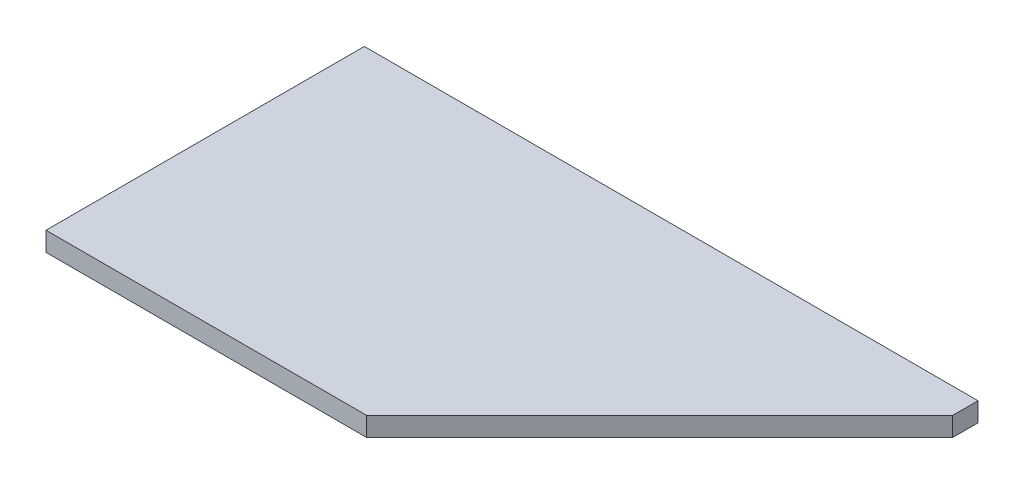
ISO-10303-21;
HEADER;
FILE_DESCRIPTION(('STEP AP214'),'2;1');
FILE_NAME('part.step','',(''),(''),'','','');
FILE_SCHEMA(('AUTOMOTIVE_DESIGN { 1 0 10303 214 1 1 1 1 }'));
ENDSEC;
DATA;
#1=APPLICATION_CONTEXT('core data for automotive mechanical design processes');
#2=APPLICATION_PROTOCOL_DEFINITION('international standard','automotive_design',2000,#1);
#3=PRODUCT_CONTEXT('',#1,'mechanical');
#4=PRODUCT('Part','Part','',(#3));
#5=PRODUCT_RELATED_PRODUCT_CATEGORY('part','',(#4));
#6=PRODUCT_DEFINITION_FORMATION('','',#4);
#7=PRODUCT_DEFINITION_CONTEXT('part definition',#1,'design');
#8=PRODUCT_DEFINITION('design','',#6,#7);
#9=PRODUCT_DEFINITION_SHAPE('','',#8);
#10=(LENGTH_UNIT() NAMED_UNIT(*) SI_UNIT(.MILLI.,.METRE.));
#11=(NAMED_UNIT(*) PLANE_ANGLE_UNIT() SI_UNIT($,.RADIAN.));
#12=(NAMED_UNIT(*) SI_UNIT($,.STERADIAN.) SOLID_ANGLE_UNIT());
#13=UNCERTAINTY_MEASURE_WITH_UNIT(LENGTH_MEASURE(1.E-05),#10,'distance_accuracy_value','');
#14=(GEOMETRIC_REPRESENTATION_CONTEXT(3) GLOBAL_UNCERTAINTY_ASSIGNED_CONTEXT((#13)) GLOBAL_UNIT_ASSIGNED_CONTEXT((#10,
#11,#12)) REPRESENTATION_CONTEXT('',''));
#15=CARTESIAN_POINT('',(0.,0.,0.));
#16=DIRECTION('',(0.,0.,1.));
#17=DIRECTION('',(1.,0.,0.));
#18=AXIS2_PLACEMENT_3D('',#15,#16,#17);
#19=CARTESIAN_POINT('',(8.,0.5,-4.15));
#20=DIRECTION('',(-1.,0.,0.));
#21=DIRECTION('',(0.,0.,1.));
#22=AXIS2_PLACEMENT_3D('',#19,#20,#21);
#23=PLANE('',#22);
#24=DIRECTION('',(0.,0.,-1.));
#25=VECTOR('',#24,1.);
#26=CARTESIAN_POINT('',(8.,0.5,-4.15));
#27=LINE('',#26,#25);
#28=CARTESIAN_POINT('',(8.,0.5,-3.48713203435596));
#29=VERTEX_POINT('',#28);
#30=CARTESIAN_POINT('',(8.,0.5,-4.15));
#31=VERTEX_POINT('',#30);
#32=EDGE_CURVE('E84',#29,#31,#27,.T.);
#33=ORIENTED_EDGE('',*,*,#32,.F.);
#34=DIRECTION('',(0.,1.,0.));
#35=VECTOR('',#34,1.);
#36=CARTESIAN_POINT('',(8.,0.,-3.48713203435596));
#37=LINE('',#36,#35);
#38=CARTESIAN_POINT('',(8.,0.,-3.48713203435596));
#39=VERTEX_POINT('',#38);
#40=EDGE_CURVE('E95',#39,#29,#37,.T.);
#41=ORIENTED_EDGE('',*,*,#40,.F.);
#42=DIRECTION('',(0.,0.,-1.));
#43=VECTOR('',#42,1.);
#44=CARTESIAN_POINT('',(8.,0.,-4.15));
#45=LINE('',#44,#43);
#46=CARTESIAN_POINT('',(8.,0.,-4.15));
#47=VERTEX_POINT('',#46);
#48=EDGE_CURVE('E105',#39,#47,#45,.T.);
#49=ORIENTED_EDGE('',*,*,#48,.T.);
#50=DIRECTION('',(0.,-1.,0.));
#51=VECTOR('',#50,1.);
#52=CARTESIAN_POINT('',(8.,0.5,-4.15));
#53=LINE('',#52,#51);
#54=EDGE_CURVE('E11',#31,#47,#53,.T.);
#55=ORIENTED_EDGE('',*,*,#54,.F.);
#56=EDGE_LOOP('',(#33,#41,#49,#55));
#57=FACE_BOUND('',#56,.T.);
#58=ADVANCED_FACE('F38',(#57),#23,.F.);
#59=CARTESIAN_POINT('',(-8.,0.5,-4.15));
#60=DIRECTION('',(0.,0.,1.));
#61=DIRECTION('',(1.,0.,0.));
#62=AXIS2_PLACEMENT_3D('',#59,#60,#61);
#63=PLANE('',#62);
#64=DIRECTION('',(-1.,0.,0.));
#65=VECTOR('',#64,1.);
#66=CARTESIAN_POINT('',(-8.,0.,-4.15));
#67=LINE('',#66,#65);
#68=CARTESIAN_POINT('',(-8.,0.,-4.15));
#69=VERTEX_POINT('',#68);
#70=EDGE_CURVE('E110',#47,#69,#67,.T.);
#71=ORIENTED_EDGE('',*,*,#70,.T.);
#72=DIRECTION('',(0.,-1.,0.));
#73=VECTOR('',#72,1.);
#74=CARTESIAN_POINT('',(-8.,0.5,-4.15));
#75=LINE('',#74,#73);
#76=CARTESIAN_POINT('',(-8.,0.5,-4.15));
#77=VERTEX_POINT('',#76);
#78=EDGE_CURVE('E46',#77,#69,#75,.T.);
#79=ORIENTED_EDGE('',*,*,#78,.F.);
#80=DIRECTION('',(-1.,0.,0.));
#81=VECTOR('',#80,1.);
#82=CARTESIAN_POINT('',(-8.,0.5,-4.15));
#83=LINE('',#82,#81);
#84=EDGE_CURVE('E138',#31,#77,#83,.T.);
#85=ORIENTED_EDGE('',*,*,#84,.F.);
#86=ORIENTED_EDGE('',*,*,#54,.T.);
#87=EDGE_LOOP('',(#71,#79,#85,#86));
#88=FACE_BOUND('',#87,.T.);
#89=ADVANCED_FACE('F155',(#88),#63,.F.);
#90=CARTESIAN_POINT('',(-8.,0.5,-4.15));
#91=DIRECTION('',(1.,0.,0.));
#92=DIRECTION('',(0.,0.,-1.));
#93=AXIS2_PLACEMENT_3D('',#90,#91,#92);
#94=PLANE('',#93);
#95=DIRECTION('',(0.,0.,1.));
#96=VECTOR('',#95,1.);
#97=CARTESIAN_POINT('',(-8.,0.,-4.15));
#98=LINE('',#97,#96);
#99=CARTESIAN_POINT('',(-8.,0.,4.15));
#100=VERTEX_POINT('',#99);
#101=EDGE_CURVE('E79',#69,#100,#98,.T.);
#102=ORIENTED_EDGE('',*,*,#101,.T.);
#103=DIRECTION('',(0.,-1.,0.));
#104=VECTOR('',#103,1.);
#105=CARTESIAN_POINT('',(-8.,0.5,4.15));
#106=LINE('',#105,#104);
#107=CARTESIAN_POINT('',(-8.,0.5,4.15));
#108=VERTEX_POINT('',#107);
#109=EDGE_CURVE('E127',#108,#100,#106,.T.);
#110=ORIENTED_EDGE('',*,*,#109,.F.);
#111=DIRECTION('',(0.,0.,1.));
#112=VECTOR('',#111,1.);
#113=CARTESIAN_POINT('',(-8.,0.5,-4.15));
#114=LINE('',#113,#112);
#115=EDGE_CURVE('E62',#77,#108,#114,.T.);
#116=ORIENTED_EDGE('',*,*,#115,.F.);
#117=ORIENTED_EDGE('',*,*,#78,.T.);
#118=EDGE_LOOP('',(#102,#110,#116,#117));
#119=FACE_BOUND('',#118,.T.);
#120=ADVANCED_FACE('F132',(#119),#94,.F.);
#121=CARTESIAN_POINT('',(-8.,0.5,4.15));
#122=DIRECTION('',(0.,0.,-1.));
#123=DIRECTION('',(-1.,0.,0.));
#124=AXIS2_PLACEMENT_3D('',#121,#122,#123);
#125=PLANE('',#124);
#126=DIRECTION('',(1.,0.,0.));
#127=VECTOR('',#126,1.);
#128=CARTESIAN_POINT('',(-8.,0.,4.15));
#129=LINE('',#128,#127);
#130=CARTESIAN_POINT('',(0.362867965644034,0.,4.15));
#131=VERTEX_POINT('',#130);
#132=EDGE_CURVE('E124',#100,#131,#129,.T.);
#133=ORIENTED_EDGE('',*,*,#132,.T.);
#134=DIRECTION('',(0.,1.,0.));
#135=VECTOR('',#134,1.);
#136=CARTESIAN_POINT('',(0.362867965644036,0.,4.15));
#137=LINE('',#136,#135);
#138=CARTESIAN_POINT('',(0.362867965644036,0.5,4.15));
#139=VERTEX_POINT('',#138);
#140=EDGE_CURVE('E53',#131,#139,#137,.T.);
#141=ORIENTED_EDGE('',*,*,#140,.T.);
#142=DIRECTION('',(1.,0.,0.));
#143=VECTOR('',#142,1.);
#144=CARTESIAN_POINT('',(-8.,0.5,4.15));
#145=LINE('',#144,#143);
#146=EDGE_CURVE('E119',#108,#139,#145,.T.);
#147=ORIENTED_EDGE('',*,*,#146,.F.);
#148=ORIENTED_EDGE('',*,*,#109,.T.);
#149=EDGE_LOOP('',(#133,#141,#147,#148));
#150=FACE_BOUND('',#149,.T.);
#151=ADVANCED_FACE('F135',(#150),#125,.F.);
#152=CARTESIAN_POINT('',(0.,0.5,0.));
#153=DIRECTION('',(0.,1.,0.));
#154=DIRECTION('',(0.,0.,1.));
#155=AXIS2_PLACEMENT_3D('',#152,#153,#154);
#156=PLANE('',#155);
#157=DIRECTION('',(-0.707106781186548,0.,0.707106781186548));
#158=VECTOR('',#157,1.);
#159=CARTESIAN_POINT('',(0.362867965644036,0.5,4.15));
#160=LINE('',#159,#158);
#161=EDGE_CURVE('E101',#29,#139,#160,.T.);
#162=ORIENTED_EDGE('',*,*,#161,.F.);
#163=ORIENTED_EDGE('',*,*,#32,.T.);
#164=ORIENTED_EDGE('',*,*,#84,.T.);
#165=ORIENTED_EDGE('',*,*,#115,.T.);
#166=ORIENTED_EDGE('',*,*,#146,.T.);
#167=EDGE_LOOP('',(#162,#163,#164,#165,#166));
#168=FACE_BOUND('',#167,.T.);
#169=ADVANCED_FACE('F144',(#168),#156,.T.);
#170=CARTESIAN_POINT('',(0.,0.,0.));
#171=DIRECTION('',(0.,1.,0.));
#172=DIRECTION('',(0.,0.,1.));
#173=AXIS2_PLACEMENT_3D('',#170,#171,#172);
#174=PLANE('',#173);
#175=ORIENTED_EDGE('',*,*,#48,.F.);
#176=DIRECTION('',(-0.707106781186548,0.,0.707106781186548));
#177=VECTOR('',#176,1.);
#178=CARTESIAN_POINT('',(0.362867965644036,0.,4.15));
#179=LINE('',#178,#177);
#180=EDGE_CURVE('E92',#39,#131,#179,.T.);
#181=ORIENTED_EDGE('',*,*,#180,.T.);
#182=ORIENTED_EDGE('',*,*,#132,.F.);
#183=ORIENTED_EDGE('',*,*,#101,.F.);
#184=ORIENTED_EDGE('',*,*,#70,.F.);
#185=EDGE_LOOP('',(#175,#181,#182,#183,#184));
#186=FACE_BOUND('',#185,.T.);
#187=ADVANCED_FACE('F109',(#186),#174,.F.);
#188=CARTESIAN_POINT('',(0.362867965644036,0.,4.15));
#189=DIRECTION('',(-0.707106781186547,0.,-0.707106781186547));
#190=DIRECTION('',(-0.707106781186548,0.,0.707106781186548));
#191=AXIS2_PLACEMENT_3D('',#188,#189,#190);
#192=PLANE('',#191);
#193=ORIENTED_EDGE('',*,*,#161,.T.);
#194=ORIENTED_EDGE('',*,*,#140,.F.);
#195=ORIENTED_EDGE('',*,*,#180,.F.);
#196=ORIENTED_EDGE('',*,*,#40,.T.);
#197=EDGE_LOOP('',(#193,#194,#195,#196));
#198=FACE_BOUND('',#197,.T.);
#199=ADVANCED_FACE('F94',(#198),#192,.F.);
#200=CLOSED_SHELL('',(#58,#89,#120,#151,#169,#187,#199));
#201=MANIFOLD_SOLID_BREP('B2',#200);
#202=ADVANCED_BREP_SHAPE_REPRESENTATION('',(#18,#201),#14);
#203=SHAPE_DEFINITION_REPRESENTATION(#9,#202);
ENDSEC;
END-ISO-10303-21;
